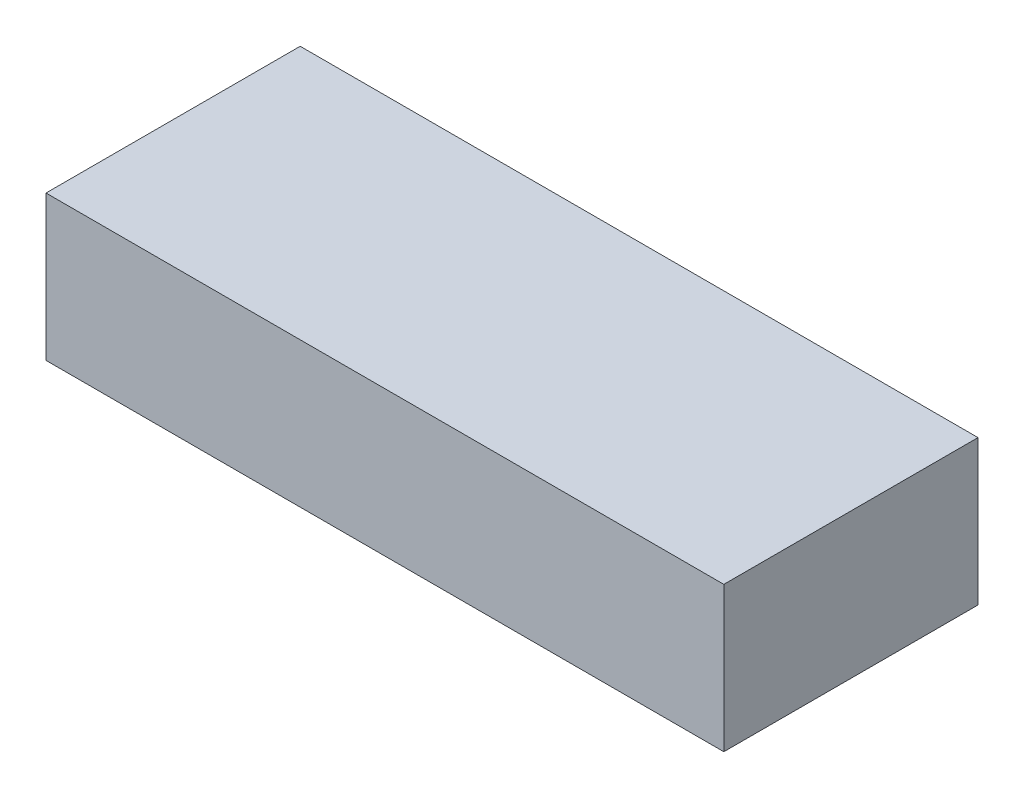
ISO-10303-21;
HEADER;
FILE_DESCRIPTION(('STEP AP214'),'2;1');
FILE_NAME('part.step','',(''),(''),'','','');
FILE_SCHEMA(('AUTOMOTIVE_DESIGN { 1 0 10303 214 1 1 1 1 }'));
ENDSEC;
DATA;
#1=APPLICATION_CONTEXT('core data for automotive mechanical design processes');
#2=APPLICATION_PROTOCOL_DEFINITION('international standard','automotive_design',2000,#1);
#3=PRODUCT_CONTEXT('',#1,'mechanical');
#4=PRODUCT('Part','Part','',(#3));
#5=PRODUCT_RELATED_PRODUCT_CATEGORY('part','',(#4));
#6=PRODUCT_DEFINITION_FORMATION('','',#4);
#7=PRODUCT_DEFINITION_CONTEXT('part definition',#1,'design');
#8=PRODUCT_DEFINITION('design','',#6,#7);
#9=PRODUCT_DEFINITION_SHAPE('','',#8);
#10=(LENGTH_UNIT() NAMED_UNIT(*) SI_UNIT(.MILLI.,.METRE.));
#11=(NAMED_UNIT(*) PLANE_ANGLE_UNIT() SI_UNIT($,.RADIAN.));
#12=(NAMED_UNIT(*) SI_UNIT($,.STERADIAN.) SOLID_ANGLE_UNIT());
#13=UNCERTAINTY_MEASURE_WITH_UNIT(LENGTH_MEASURE(1.E-05),#10,'distance_accuracy_value','');
#14=(GEOMETRIC_REPRESENTATION_CONTEXT(3) GLOBAL_UNCERTAINTY_ASSIGNED_CONTEXT((#13)) GLOBAL_UNIT_ASSIGNED_CONTEXT((#10,
#11,#12)) REPRESENTATION_CONTEXT('',''));
#15=CARTESIAN_POINT('',(0.,0.,0.));
#16=DIRECTION('',(0.,0.,1.));
#17=DIRECTION('',(1.,0.,0.));
#18=AXIS2_PLACEMENT_3D('',#15,#16,#17);
#19=CARTESIAN_POINT('',(0.,8.8,0.));
#20=DIRECTION('',(0.,-1.,0.));
#21=DIRECTION('',(0.,0.,-1.));
#22=AXIS2_PLACEMENT_3D('',#19,#20,#21);
#23=PLANE('',#22);
#24=DIRECTION('',(-1.,0.,0.));
#25=VECTOR('',#24,1.);
#26=CARTESIAN_POINT('',(-4.6948051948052,8.8,18.6038961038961));
#27=LINE('',#26,#25);
#28=CARTESIAN_POINT('',(-4.6948051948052,8.8,18.6038961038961));
#29=VERTEX_POINT('',#28);
#30=CARTESIAN_POINT('',(-5.62987012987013,8.8,18.6038961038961));
#31=VERTEX_POINT('',#30);
#32=EDGE_CURVE('E69',#29,#31,#27,.T.);
#33=ORIENTED_EDGE('',*,*,#32,.T.);
#34=DIRECTION('',(0.,0.,-1.));
#35=VECTOR('',#34,1.);
#36=CARTESIAN_POINT('',(-5.62987012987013,8.8,18.6038961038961));
#37=LINE('',#36,#35);
#38=CARTESIAN_POINT('',(-5.62987012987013,8.8,18.2532467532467));
#39=VERTEX_POINT('',#38);
#40=EDGE_CURVE('E19',#31,#39,#37,.T.);
#41=ORIENTED_EDGE('',*,*,#40,.T.);
#42=DIRECTION('',(1.,0.,0.));
#43=VECTOR('',#42,1.);
#44=CARTESIAN_POINT('',(-5.62987012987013,8.8,18.2532467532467));
#45=LINE('',#44,#43);
#46=CARTESIAN_POINT('',(-4.6948051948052,8.8,18.2532467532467));
#47=VERTEX_POINT('',#46);
#48=EDGE_CURVE('E71',#39,#47,#45,.T.);
#49=ORIENTED_EDGE('',*,*,#48,.T.);
#50=DIRECTION('',(0.,0.,1.));
#51=VECTOR('',#50,1.);
#52=CARTESIAN_POINT('',(-4.6948051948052,8.8,18.2532467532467));
#53=LINE('',#52,#51);
#54=EDGE_CURVE('E66',#47,#29,#53,.T.);
#55=ORIENTED_EDGE('',*,*,#54,.T.);
#56=EDGE_LOOP('',(#33,#41,#49,#55));
#57=FACE_BOUND('',#56,.T.);
#58=ADVANCED_FACE('F16',(#57),#23,.T.);
#59=CARTESIAN_POINT('',(0.,9.,0.));
#60=DIRECTION('',(0.,-1.,0.));
#61=DIRECTION('',(0.,0.,-1.));
#62=AXIS2_PLACEMENT_3D('',#59,#60,#61);
#63=PLANE('',#62);
#64=DIRECTION('',(-1.,0.,0.));
#65=VECTOR('',#64,1.);
#66=CARTESIAN_POINT('',(-4.6948051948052,9.,18.6038961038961));
#67=LINE('',#66,#65);
#68=CARTESIAN_POINT('',(-4.6948051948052,9.,18.6038961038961));
#69=VERTEX_POINT('',#68);
#70=CARTESIAN_POINT('',(-5.62987012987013,9.,18.6038961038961));
#71=VERTEX_POINT('',#70);
#72=EDGE_CURVE('E88',#69,#71,#67,.T.);
#73=ORIENTED_EDGE('',*,*,#72,.F.);
#74=DIRECTION('',(0.,0.,1.));
#75=VECTOR('',#74,1.);
#76=CARTESIAN_POINT('',(-4.6948051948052,9.,18.2532467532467));
#77=LINE('',#76,#75);
#78=CARTESIAN_POINT('',(-4.6948051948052,9.,18.2532467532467));
#79=VERTEX_POINT('',#78);
#80=EDGE_CURVE('E83',#79,#69,#77,.T.);
#81=ORIENTED_EDGE('',*,*,#80,.F.);
#82=DIRECTION('',(1.,0.,0.));
#83=VECTOR('',#82,1.);
#84=CARTESIAN_POINT('',(-5.62987012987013,9.,18.2532467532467));
#85=LINE('',#84,#83);
#86=CARTESIAN_POINT('',(-5.62987012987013,9.,18.2532467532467));
#87=VERTEX_POINT('',#86);
#88=EDGE_CURVE('E108',#87,#79,#85,.T.);
#89=ORIENTED_EDGE('',*,*,#88,.F.);
#90=DIRECTION('',(0.,0.,-1.));
#91=VECTOR('',#90,1.);
#92=CARTESIAN_POINT('',(-5.62987012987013,9.,18.6038961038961));
#93=LINE('',#92,#91);
#94=EDGE_CURVE('E11',#71,#87,#93,.T.);
#95=ORIENTED_EDGE('',*,*,#94,.F.);
#96=EDGE_LOOP('',(#73,#81,#89,#95));
#97=FACE_BOUND('',#96,.T.);
#98=ADVANCED_FACE('F149',(#97),#63,.F.);
#99=CARTESIAN_POINT('',(-5.62987012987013,9.,18.6038961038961));
#100=DIRECTION('',(-1.,0.,0.));
#101=DIRECTION('',(0.,0.,1.));
#102=AXIS2_PLACEMENT_3D('',#99,#100,#101);
#103=PLANE('',#102);
#104=ORIENTED_EDGE('',*,*,#40,.F.);
#105=DIRECTION('',(0.,-1.,0.));
#106=VECTOR('',#105,1.);
#107=CARTESIAN_POINT('',(-5.62987012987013,9.,18.6038961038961));
#108=LINE('',#107,#106);
#109=EDGE_CURVE('E77',#71,#31,#108,.T.);
#110=ORIENTED_EDGE('',*,*,#109,.F.);
#111=ORIENTED_EDGE('',*,*,#94,.T.);
#112=DIRECTION('',(0.,-1.,0.));
#113=VECTOR('',#112,1.);
#114=CARTESIAN_POINT('',(-5.62987012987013,9.,18.2532467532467));
#115=LINE('',#114,#113);
#116=EDGE_CURVE('E106',#87,#39,#115,.T.);
#117=ORIENTED_EDGE('',*,*,#116,.T.);
#118=EDGE_LOOP('',(#104,#110,#111,#117));
#119=FACE_BOUND('',#118,.T.);
#120=ADVANCED_FACE('F140',(#119),#103,.T.);
#121=CARTESIAN_POINT('',(-5.62987012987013,9.,18.2532467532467));
#122=DIRECTION('',(0.,0.,-1.));
#123=DIRECTION('',(0.,-1.,0.));
#124=AXIS2_PLACEMENT_3D('',#121,#122,#123);
#125=PLANE('',#124);
#126=ORIENTED_EDGE('',*,*,#48,.F.);
#127=ORIENTED_EDGE('',*,*,#116,.F.);
#128=ORIENTED_EDGE('',*,*,#88,.T.);
#129=DIRECTION('',(0.,-1.,0.));
#130=VECTOR('',#129,1.);
#131=CARTESIAN_POINT('',(-4.6948051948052,9.,18.2532467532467));
#132=LINE('',#131,#130);
#133=EDGE_CURVE('E76',#79,#47,#132,.T.);
#134=ORIENTED_EDGE('',*,*,#133,.T.);
#135=EDGE_LOOP('',(#126,#127,#128,#134));
#136=FACE_BOUND('',#135,.T.);
#137=ADVANCED_FACE('F131',(#136),#125,.T.);
#138=CARTESIAN_POINT('',(-4.6948051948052,9.,18.2532467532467));
#139=DIRECTION('',(1.,0.,0.));
#140=DIRECTION('',(0.,1.,0.));
#141=AXIS2_PLACEMENT_3D('',#138,#139,#140);
#142=PLANE('',#141);
#143=ORIENTED_EDGE('',*,*,#54,.F.);
#144=ORIENTED_EDGE('',*,*,#133,.F.);
#145=ORIENTED_EDGE('',*,*,#80,.T.);
#146=DIRECTION('',(0.,-1.,0.));
#147=VECTOR('',#146,1.);
#148=CARTESIAN_POINT('',(-4.6948051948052,9.,18.6038961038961));
#149=LINE('',#148,#147);
#150=EDGE_CURVE('E80',#69,#29,#149,.T.);
#151=ORIENTED_EDGE('',*,*,#150,.T.);
#152=EDGE_LOOP('',(#143,#144,#145,#151));
#153=FACE_BOUND('',#152,.T.);
#154=ADVANCED_FACE('F81',(#153),#142,.T.);
#155=CARTESIAN_POINT('',(-4.6948051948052,9.,18.6038961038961));
#156=DIRECTION('',(0.,0.,1.));
#157=DIRECTION('',(1.,0.,0.));
#158=AXIS2_PLACEMENT_3D('',#155,#156,#157);
#159=PLANE('',#158);
#160=ORIENTED_EDGE('',*,*,#32,.F.);
#161=ORIENTED_EDGE('',*,*,#150,.F.);
#162=ORIENTED_EDGE('',*,*,#72,.T.);
#163=ORIENTED_EDGE('',*,*,#109,.T.);
#164=EDGE_LOOP('',(#160,#161,#162,#163));
#165=FACE_BOUND('',#164,.T.);
#166=ADVANCED_FACE('F91',(#165),#159,.T.);
#167=CLOSED_SHELL('',(#58,#98,#120,#137,#154,#166));
#168=MANIFOLD_SOLID_BREP('B1',#167);
#169=ADVANCED_BREP_SHAPE_REPRESENTATION('',(#18,#168),#14);
#170=SHAPE_DEFINITION_REPRESENTATION(#9,#169);
ENDSEC;
END-ISO-10303-21;
